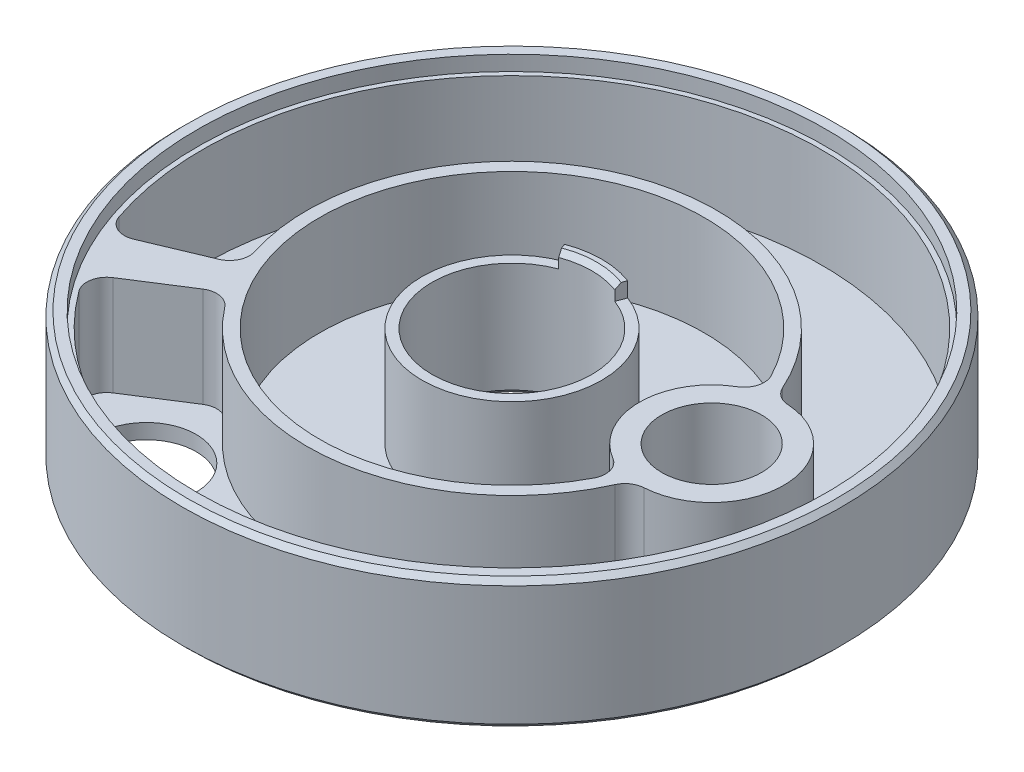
from build123d import *

# Parameters (mm, degrees)
SKETCH1_R           = 33
SKETCH1_R_2         = 8
BOSS_EXTRUDE1_DEPTH = 13
SKETCH2_R           = 31.5
CUT_EXTRUDE1_DEPTH  = 1.5
CHAMFER1_SIZE       = 0.5
SKETCH3_R           = 5
CUT_EXTRUDE2_DEPTH  = 49.065060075
SKETCH4_R           = 9
CUT_EXTRUDE3_DEPTH  = 10
SKETCH5_R           = 5
CUT_EXTRUDE4_DEPTH  = 49.065060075


with BuildPart() as part:
    # Sketch1 → Boss-Extrude1 (new body)
    with BuildSketch(Plane(origin=(0, 0, 0), x_dir=(1, 0, 0), z_dir=(0, 1, 0))):
        with Locations(Location((0, 0, 0), (0, 0, 270))):
            Circle(SKETCH1_R)
        with Locations(Location((0, 0, 0), (0, 0, 270))):
            Circle(SKETCH1_R_2, mode=Mode.SUBTRACT)
    extrude(amount=-BOSS_EXTRUDE1_DEPTH)

    # Sketch2 → Cut-Extrude1 (cut)
    with BuildSketch(Plane(origin=(0, 0, 0), x_dir=(1, 0, 0), z_dir=(0, 1, 0))):
        with Locations(Location((0, 0, 0), (0, 0, 270))):
            Circle(SKETCH2_R)
        with BuildLine():
            Line((2.808987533, 7.490633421), (3, 8))
            Line((3, 8), (3.160110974, 8.426962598))
            ThreePointArc((3.160110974, 8.426962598), (0, 9), (-3.160110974, 8.426962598))
            Line((-3.160110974, 8.426962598), (-3, 8))
            Line((-3, 8), (-2.808987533, 7.490633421))
            ThreePointArc((-2.808987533, 7.490633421), (0, -8), (2.808987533, 7.490633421))
        make_face(mode=Mode.SUBTRACT)
    extrude(amount=-CUT_EXTRUDE1_DEPTH, mode=Mode.SUBTRACT)

    # Chamfer1
    chamfer1_edges = [part.edges().sort_by_distance(p)[0] for p in [
        (0, 0, -33),
        (0, -13, -33),
        (0, -13, -8),
        (0, 0, -8),
    ]]
    chamfer(chamfer1_edges, length=CHAMFER1_SIZE)

    # Sketch3 → Cut-Extrude2 (cut, through all)
    with BuildSketch(Plane(origin=(0, -1.5, 0), x_dir=(1, 0, 0), z_dir=(0, 1, 0))):
        with Locations(Location((20, 0, 0), (0, 0, 270))):
            Circle(SKETCH3_R)
    extrude(amount=-CUT_EXTRUDE2_DEPTH, mode=Mode.SUBTRACT)

    # Sketch4 → Cut-Extrude3 (cut)
    # profile 1 of 2: a face of its own
    with BuildSketch(Plane(origin=(0, -1.5, 0), x_dir=(1, 0, 0), z_dir=(0, 1, 0))):
        with BuildLine():
            Line((-18.886739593, -12.064040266), (-24.381462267, -15.573833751))
            ThreePointArc((-24.381462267, -15.573833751), (-25.271643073, -16.896434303), (-24.912071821, -18.449625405))
            ThreePointArc((-24.912071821, -18.449625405), (27.452726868, 14.399575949), (-29.340406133, -10.00702593))
            ThreePointArc((-29.340406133, -10.00702593), (-28.267002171, -11.185795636), (-26.672852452, -11.205308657))
            Line((-26.672852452, -11.205308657), (-20.661731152, -8.680026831))
            ThreePointArc((-20.661731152, -8.680026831), (-19.62025162, -7.673844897), (-19.530901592, -6.22847357))
            ThreePointArc((-19.530901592, -6.22847357), (-7.318896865, 19.14898819), (18.70625, 8.386072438))
            ThreePointArc((18.70625, 8.386072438), (19.396187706, 7.557521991), (20.416005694, 7.20754892))
            ThreePointArc((20.416005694, 7.20754892), (27.219544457, 0), (20.416005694, -7.20754892))
            ThreePointArc((20.416005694, -7.20754892), (19.396187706, -7.557521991), (18.70625, -8.386072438))
            ThreePointArc((18.70625, -8.386072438), (2.413343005, -20.357450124), (-16.226997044, -12.527352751))
            ThreePointArc((-16.226997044, -12.527352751), (-17.466898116, -11.77920368), (-18.886739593, -12.064040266))
        make_face()
    # profile 2 of 2: a face of its own
    with BuildSketch(Plane(origin=(0, -1.5, 0), x_dir=(1, 0, 0), z_dir=(0, 1, 0))):
        with BuildLine():
            ThreePointArc((16.330585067, 6.21749276), (12.780455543, 0), (16.330585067, -6.21749276))
            ThreePointArc((16.330585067, -6.21749276), (17.236362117, -7.387844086), (17.089605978, -8.860466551))
            ThreePointArc((17.089605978, -8.860466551), (-19.25, 0), (17.089605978, 8.860466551))
            ThreePointArc((17.089605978, 8.860466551), (17.236362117, 7.387844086), (16.330585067, 6.21749276))
        make_face()
        with Locations(Location((0, 0, 0), (0, 0, 270))):
            Circle(SKETCH4_R, mode=Mode.SUBTRACT)
    extrude(amount=-CUT_EXTRUDE3_DEPTH, mode=Mode.SUBTRACT)

    # Sketch5 → Cut-Extrude4 (cut, through all)
    with BuildSketch(Plane(origin=(0, -11.5, 0), x_dir=(1, 0, 0), z_dir=(0, 1, 0))):
        with Locations(Location((-16.613247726, -20, 0), (0, 0, 270))):
            Circle(SKETCH5_R)
    extrude(amount=-CUT_EXTRUDE4_DEPTH, mode=Mode.SUBTRACT)


solid = part.part
